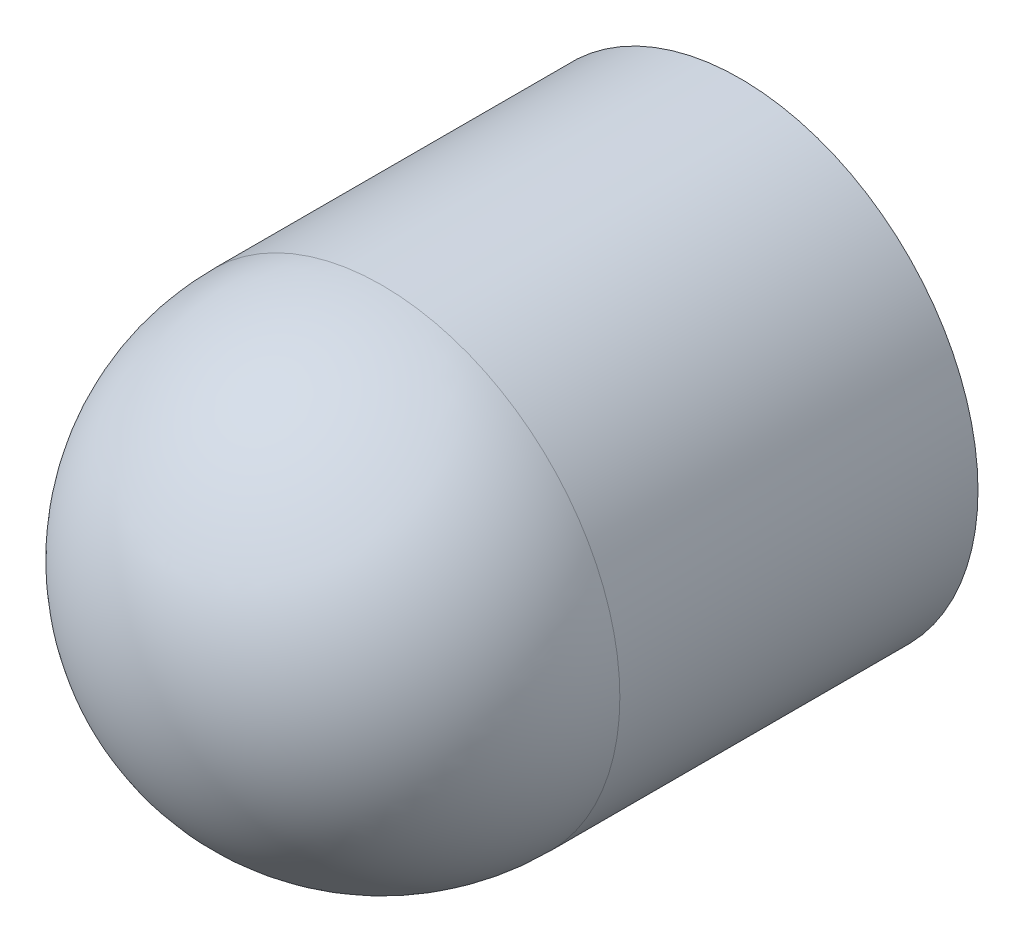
from build123d import *


with BuildPart() as part:
    # Sketch 1 → Revolve 1 (revolve)
    with BuildSketch(Plane(origin=(0, 0, 0), x_dir=(0, 0, -1), z_dir=(1, 0, 0))):
        with BuildLine():
            Line((0, 0), (7.9248, 0))
            Line((7.9248, 0), (7.9248, 3.1623))
            Line((7.9248, 3.1623), (3.1623, 3.1623))
            ThreePointArc((3.1623, 3.1623), (0.926216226, 2.236083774), (0, 0))
        make_face()
    revolve(axis=Axis((0, 0, 0), (0, 0, -1)))


solid = part.part
